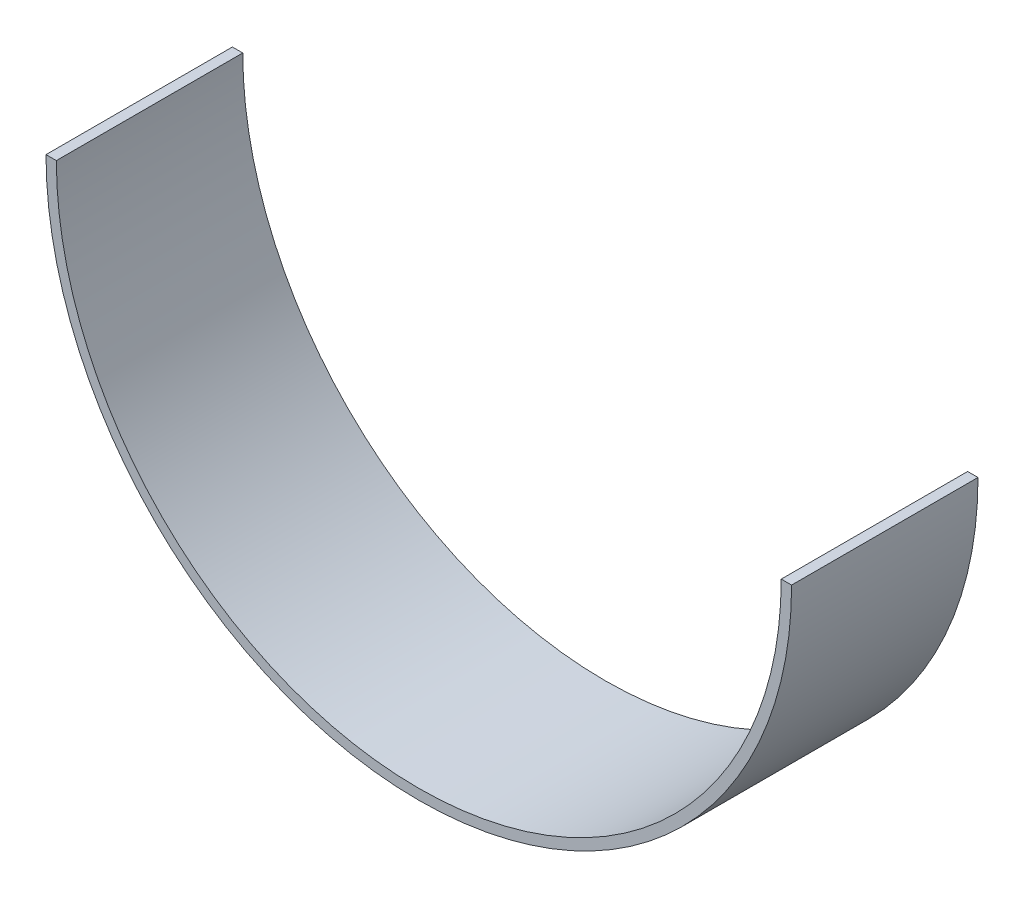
from build123d import *

# Parameters (mm, degrees)
EXTRUDE1_DEPTH = 57.15


with BuildPart() as part:
    # Sketch1 → Extrude1 (new body)
    with BuildSketch(Plane.XY):
        with BuildLine():
            Line((0, 0), (3.175, 0))
            ThreePointArc((3.175, 0), (114.3, -111.125), (225.425, 0))
            Line((225.425, 0), (228.6, 0))
            ThreePointArc((228.6, 0), (114.3, -114.3), (0, 0))
        make_face()
    extrude(amount=EXTRUDE1_DEPTH)


solid = part.part
